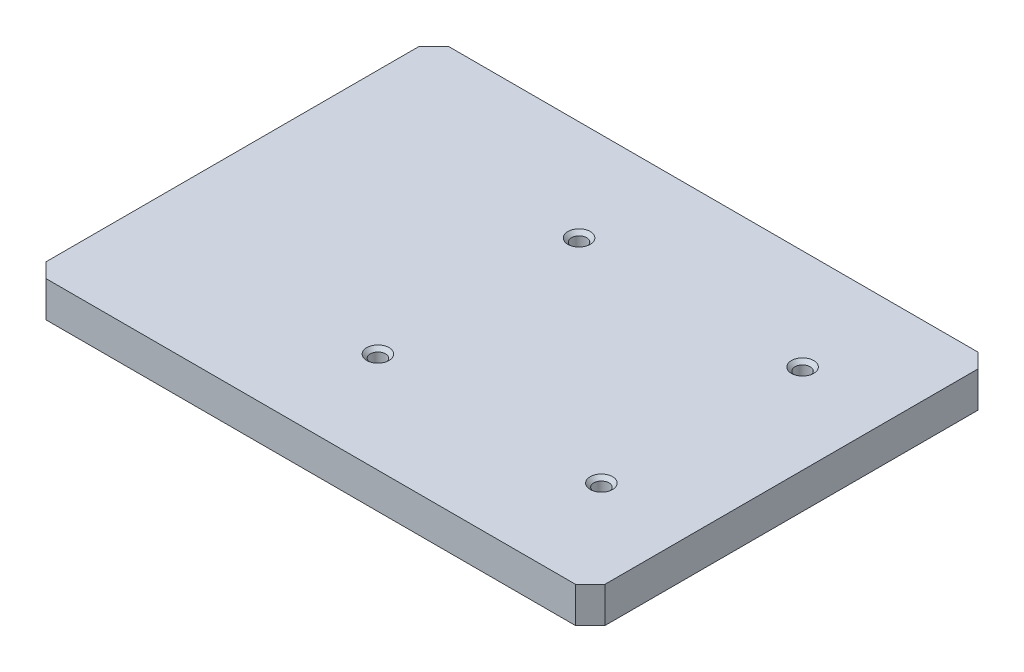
from build123d import *

# Parameters (mm, degrees)
SKETCH1_W                   = 250
SKETCH1_H                   = 180
BOSS_EXTRUDE1_DEPTH         = 16
M8_TAPPED_HOLE1_D           = 6.8
M8_TAPPED_HOLE1_CSINK_D     = 10
M8_TAPPED_HOLE1_CSINK_ANGLE = 90
CHAMFER1_SIZE               = 6.5


with BuildPart() as part:
    # Sketch1 → Boss-Extrude1 (new body)
    with BuildSketch(Plane(origin=(0, 0, 0), x_dir=(1, 0, 0), z_dir=(0, 1, 0))):
        Rectangle(SKETCH1_W, SKETCH1_H)
    extrude(amount=BOSS_EXTRUDE1_DEPTH)

    # M8 Tapped Hole1 (through all)
    with Locations(Plane(origin=(0, 16, 0), x_dir=(1, 0, 0), z_dir=(0, 1, 0))):
        with Locations((85, -45), (-15, -45), (-15, 45), (85, 45)):
            CounterSinkHole(M8_TAPPED_HOLE1_D / 2, M8_TAPPED_HOLE1_CSINK_D / 2, counter_sink_angle=M8_TAPPED_HOLE1_CSINK_ANGLE)

    # Chamfer1
    chamfer1_edges = [part.edges().sort_by_distance(p)[0] for p in [
        (-125, 8, -90),
        (125, 8, -90),
        (125, 8, 90),
        (-125, 8, 90),
    ]]
    chamfer(chamfer1_edges, length=CHAMFER1_SIZE)


solid = part.part
